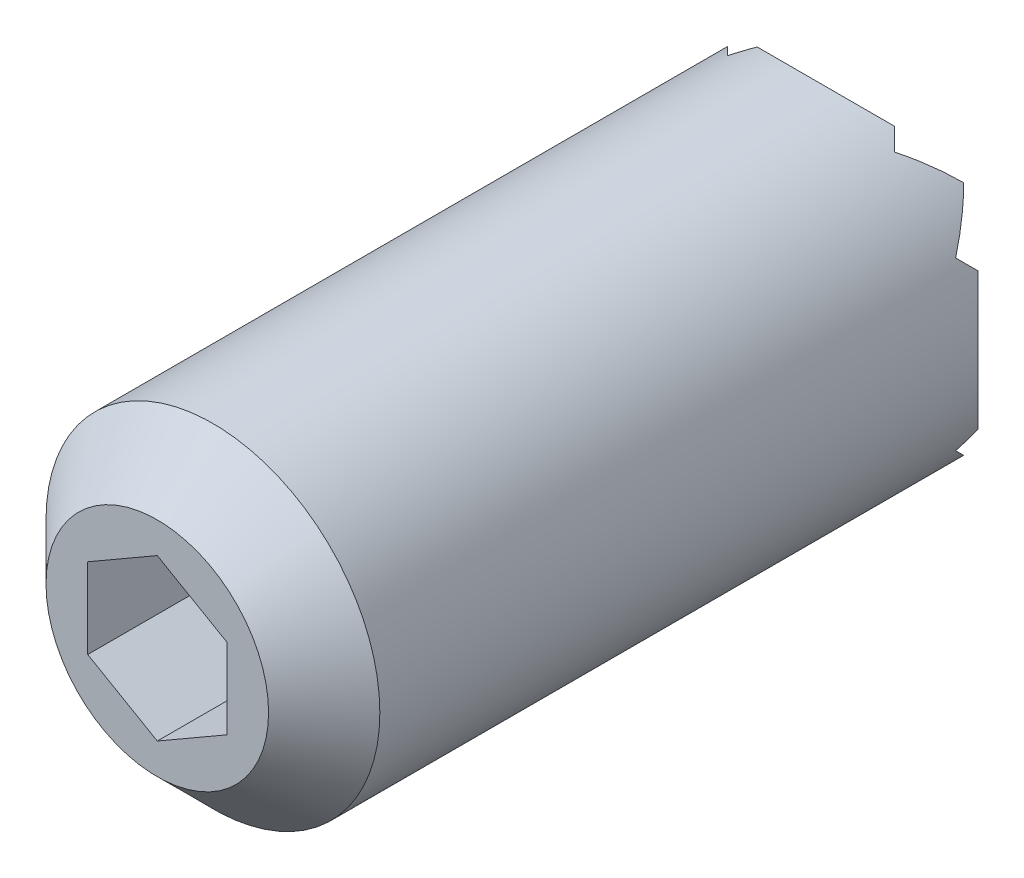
ISO-10303-21;
HEADER;
FILE_DESCRIPTION(('STEP AP214'),'2;1');
FILE_NAME('part.step','',(''),(''),'','','');
FILE_SCHEMA(('AUTOMOTIVE_DESIGN { 1 0 10303 214 1 1 1 1 }'));
ENDSEC;
DATA;
#1=APPLICATION_CONTEXT('core data for automotive mechanical design processes');
#2=APPLICATION_PROTOCOL_DEFINITION('international standard','automotive_design',2000,#1);
#3=PRODUCT_CONTEXT('',#1,'mechanical');
#4=PRODUCT('Part','Part','',(#3));
#5=PRODUCT_RELATED_PRODUCT_CATEGORY('part','',(#4));
#6=PRODUCT_DEFINITION_FORMATION('','',#4);
#7=PRODUCT_DEFINITION_CONTEXT('part definition',#1,'design');
#8=PRODUCT_DEFINITION('design','',#6,#7);
#9=PRODUCT_DEFINITION_SHAPE('','',#8);
#10=(LENGTH_UNIT() NAMED_UNIT(*) SI_UNIT(.MILLI.,.METRE.));
#11=(NAMED_UNIT(*) PLANE_ANGLE_UNIT() SI_UNIT($,.RADIAN.));
#12=(NAMED_UNIT(*) SI_UNIT($,.STERADIAN.) SOLID_ANGLE_UNIT());
#13=UNCERTAINTY_MEASURE_WITH_UNIT(LENGTH_MEASURE(1.E-05),#10,'distance_accuracy_value','');
#14=(GEOMETRIC_REPRESENTATION_CONTEXT(3) GLOBAL_UNCERTAINTY_ASSIGNED_CONTEXT((#13)) GLOBAL_UNIT_ASSIGNED_CONTEXT((#10,
#11,#12)) REPRESENTATION_CONTEXT('',''));
#15=CARTESIAN_POINT('',(0.,0.,0.));
#16=DIRECTION('',(0.,0.,1.));
#17=DIRECTION('',(1.,0.,0.));
#18=AXIS2_PLACEMENT_3D('',#15,#16,#17);
#19=CARTESIAN_POINT('',(2.9999999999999,-10.,1.5));
#20=DIRECTION('',(-0.707106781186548,0.,0.707106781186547));
#21=DIRECTION('',(0.707106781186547,0.,0.707106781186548));
#22=AXIS2_PLACEMENT_3D('',#19,#20,#21);
#23=PLANE('',#22);
#24=CARTESIAN_POINT('',(0.,0.,-1.5));
#25=DIRECTION('',(-0.707106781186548,0.,0.707106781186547));
#26=DIRECTION('',(0.707106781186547,0.,0.707106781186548));
#27=AXIS2_PLACEMENT_3D('',#24,#25,#26);
#28=ELLIPSE('',#27,8.48528137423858,6.);
#29=CARTESIAN_POINT('',(2.9999999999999,-5.19615242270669,1.5));
#30=VERTEX_POINT('',#29);
#31=CARTESIAN_POINT('',(2.46862696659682,-5.46862696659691,0.9686269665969));
#32=VERTEX_POINT('',#31);
#33=EDGE_CURVE('E361',#30,#32,#28,.F.);
#34=ORIENTED_EDGE('',*,*,#33,.T.);
#35=DIRECTION('',(-0.577350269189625,0.577350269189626,-0.577350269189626));
#36=VECTOR('',#35,1.);
#37=CARTESIAN_POINT('',(4.33333333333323,-7.33333333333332,2.83333333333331));
#38=LINE('',#37,#36);
#39=CARTESIAN_POINT('',(1.49999999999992,-4.5,0.));
#40=VERTEX_POINT('',#39);
#41=EDGE_CURVE('E281',#32,#40,#38,.T.);
#42=ORIENTED_EDGE('',*,*,#41,.T.);
#43=DIRECTION('',(0.577350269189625,0.577350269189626,0.577350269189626));
#44=VECTOR('',#43,1.);
#45=CARTESIAN_POINT('',(0.666666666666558,-5.33333333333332,-0.833333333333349));
#46=LINE('',#45,#44);
#47=CARTESIAN_POINT('',(2.9999999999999,-3.,1.5));
#48=VERTEX_POINT('',#47);
#49=EDGE_CURVE('E422',#40,#48,#46,.T.);
#50=ORIENTED_EDGE('',*,*,#49,.T.);
#51=DIRECTION('',(0.,1.,0.));
#52=VECTOR('',#51,1.);
#53=CARTESIAN_POINT('',(2.9999999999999,-10.,1.5));
#54=LINE('',#53,#52);
#55=EDGE_CURVE('E298',#30,#48,#54,.T.);
#56=ORIENTED_EDGE('',*,*,#55,.F.);
#57=EDGE_LOOP('',(#34,#42,#50,#56));
#58=FACE_BOUND('',#57,.T.);
#59=ADVANCED_FACE('F14',(#58),#23,.F.);
#60=CARTESIAN_POINT('',(-1.50000000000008,-10.,0.));
#61=DIRECTION('',(0.70710678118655,0.,0.707106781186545));
#62=DIRECTION('',(0.707106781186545,0.,-0.70710678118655));
#63=AXIS2_PLACEMENT_3D('',#60,#61,#62);
#64=PLANE('',#63);
#65=DIRECTION('',(0.577350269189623,-0.577350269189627,-0.577350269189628));
#66=VECTOR('',#65,1.);
#67=CARTESIAN_POINT('',(0.333333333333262,-6.33333333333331,-1.83333333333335));
#68=LINE('',#67,#66);
#69=CARTESIAN_POINT('',(-3.00000000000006,-3.,1.5));
#70=VERTEX_POINT('',#69);
#71=CARTESIAN_POINT('',(-1.50000000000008,-4.5,0.));
#72=VERTEX_POINT('',#71);
#73=EDGE_CURVE('E434',#70,#72,#68,.T.);
#74=ORIENTED_EDGE('',*,*,#73,.T.);
#75=DIRECTION('',(-0.577350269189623,-0.577350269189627,0.577350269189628));
#76=VECTOR('',#75,1.);
#77=CARTESIAN_POINT('',(-3.3333333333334,-6.33333333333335,1.83333333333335));
#78=LINE('',#77,#76);
#79=CARTESIAN_POINT('',(-2.46862696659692,-5.46862696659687,0.968626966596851));
#80=VERTEX_POINT('',#79);
#81=EDGE_CURVE('E9',#72,#80,#78,.T.);
#82=ORIENTED_EDGE('',*,*,#81,.T.);
#83=CARTESIAN_POINT('',(0.,0.,-1.5));
#84=DIRECTION('',(0.70710678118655,0.,0.707106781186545));
#85=DIRECTION('',(-0.707106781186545,0.,0.70710678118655));
#86=AXIS2_PLACEMENT_3D('',#83,#84,#85);
#87=ELLIPSE('',#86,8.4852813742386,6.);
#88=CARTESIAN_POINT('',(-3.00000000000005,-5.19615242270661,1.5));
#89=VERTEX_POINT('',#88);
#90=EDGE_CURVE('E365',#80,#89,#87,.F.);
#91=ORIENTED_EDGE('',*,*,#90,.T.);
#92=DIRECTION('',(0.,1.,0.));
#93=VECTOR('',#92,1.);
#94=CARTESIAN_POINT('',(-3.00000000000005,-10.,1.5));
#95=LINE('',#94,#93);
#96=EDGE_CURVE('E293',#89,#70,#95,.T.);
#97=ORIENTED_EDGE('',*,*,#96,.T.);
#98=EDGE_LOOP('',(#74,#82,#91,#97));
#99=FACE_BOUND('',#98,.T.);
#100=ADVANCED_FACE('F564',(#99),#64,.F.);
#101=CARTESIAN_POINT('',(-3.00000000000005,-10.,1.5));
#102=DIRECTION('',(-0.707106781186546,0.,0.707106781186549));
#103=DIRECTION('',(0.707106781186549,0.,0.707106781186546));
#104=AXIS2_PLACEMENT_3D('',#101,#102,#103);
#105=PLANE('',#104);
#106=CARTESIAN_POINT('',(0.,0.,4.5));
#107=DIRECTION('',(-0.707106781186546,0.,0.707106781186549));
#108=DIRECTION('',(0.707106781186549,0.,0.707106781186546));
#109=AXIS2_PLACEMENT_3D('',#106,#107,#108);
#110=ELLIPSE('',#109,8.48528137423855,6.);
#111=CARTESIAN_POINT('',(-4.24264068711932,-4.24264068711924,0.257359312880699));
#112=VERTEX_POINT('',#111);
#113=EDGE_CURVE('E367',#89,#112,#110,.F.);
#114=ORIENTED_EDGE('',*,*,#113,.T.);
#115=DIRECTION('',(0.577350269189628,0.577350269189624,0.577350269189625));
#116=VECTOR('',#115,1.);
#117=CARTESIAN_POINT('',(-5.33333333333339,-5.33333333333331,-0.833333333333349));
#118=LINE('',#117,#116);
#119=EDGE_CURVE('E436',#112,#70,#118,.T.);
#120=ORIENTED_EDGE('',*,*,#119,.T.);
#121=ORIENTED_EDGE('',*,*,#96,.F.);
#122=EDGE_LOOP('',(#114,#120,#121));
#123=FACE_BOUND('',#122,.T.);
#124=ADVANCED_FACE('F558',(#123),#105,.F.);
#125=CARTESIAN_POINT('',(-4.50000000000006,-10.,0.));
#126=DIRECTION('',(0.707106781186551,0.,0.707106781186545));
#127=DIRECTION('',(0.707106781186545,0.,-0.707106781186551));
#128=AXIS2_PLACEMENT_3D('',#125,#126,#127);
#129=PLANE('',#128);
#130=CARTESIAN_POINT('',(0.,0.,-4.5));
#131=DIRECTION('',(0.707106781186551,0.,0.707106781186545));
#132=DIRECTION('',(-0.707106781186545,0.,0.707106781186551));
#133=AXIS2_PLACEMENT_3D('',#130,#131,#132);
#134=ELLIPSE('',#133,8.48528137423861,6.);
#135=CARTESIAN_POINT('',(-6.,0.,1.5));
#136=VERTEX_POINT('',#135);
#137=CARTESIAN_POINT('',(-5.46862696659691,2.46862696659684,0.968626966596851));
#138=VERTEX_POINT('',#137);
#139=EDGE_CURVE('E371',#136,#138,#134,.F.);
#140=ORIENTED_EDGE('',*,*,#139,.T.);
#141=DIRECTION('',(0.577350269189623,-0.577350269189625,-0.577350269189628));
#142=VECTOR('',#141,1.);
#143=CARTESIAN_POINT('',(-0.666666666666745,-2.33333333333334,-3.83333333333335));
#144=LINE('',#143,#142);
#145=CARTESIAN_POINT('',(-4.50000000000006,1.5,0.));
#146=VERTEX_POINT('',#145);
#147=EDGE_CURVE('E249',#138,#146,#144,.T.);
#148=ORIENTED_EDGE('',*,*,#147,.T.);
#149=DIRECTION('',(-0.577350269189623,-0.577350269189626,0.577350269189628));
#150=VECTOR('',#149,1.);
#151=CARTESIAN_POINT('',(-8.33333333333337,-2.33333333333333,3.83333333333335));
#152=LINE('',#151,#150);
#153=EDGE_CURVE('E498',#146,#136,#152,.T.);
#154=ORIENTED_EDGE('',*,*,#153,.T.);
#155=EDGE_LOOP('',(#140,#148,#154));
#156=FACE_BOUND('',#155,.T.);
#157=ADVANCED_FACE('F680',(#156),#129,.F.);
#158=CARTESIAN_POINT('',(5.99999999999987,-10.,1.5));
#159=DIRECTION('',(-0.707106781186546,0.,0.70710678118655));
#160=DIRECTION('',(0.70710678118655,0.,0.707106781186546));
#161=AXIS2_PLACEMENT_3D('',#158,#159,#160);
#162=PLANE('',#161);
#163=DIRECTION('',(-0.577350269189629,0.577350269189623,-0.577350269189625));
#164=VECTOR('',#163,1.);
#165=CARTESIAN_POINT('',(9.33333333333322,-3.33333333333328,4.8333333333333));
#166=LINE('',#165,#164);
#167=CARTESIAN_POINT('',(5.99999999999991,0.,1.5));
#168=VERTEX_POINT('',#167);
#169=CARTESIAN_POINT('',(4.49999999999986,1.5,0.));
#170=VERTEX_POINT('',#169);
#171=EDGE_CURVE('E480',#168,#170,#166,.T.);
#172=ORIENTED_EDGE('',*,*,#171,.T.);
#173=DIRECTION('',(0.577350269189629,0.577350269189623,0.577350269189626));
#174=VECTOR('',#173,1.);
#175=CARTESIAN_POINT('',(1.66666666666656,-1.33333333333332,-2.83333333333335));
#176=LINE('',#175,#174);
#177=CARTESIAN_POINT('',(5.46862696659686,2.46862696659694,0.968626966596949));
#178=VERTEX_POINT('',#177);
#179=EDGE_CURVE('E246',#170,#178,#176,.T.);
#180=ORIENTED_EDGE('',*,*,#179,.T.);
#181=CARTESIAN_POINT('',(0.,0.,-4.5));
#182=DIRECTION('',(-0.707106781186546,0.,0.70710678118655));
#183=DIRECTION('',(0.70710678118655,0.,0.707106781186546));
#184=AXIS2_PLACEMENT_3D('',#181,#182,#183);
#185=ELLIPSE('',#184,8.48528137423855,6.);
#186=EDGE_CURVE('E237',#178,#168,#185,.F.);
#187=ORIENTED_EDGE('',*,*,#186,.T.);
#188=EDGE_LOOP('',(#172,#180,#187));
#189=FACE_BOUND('',#188,.T.);
#190=ADVANCED_FACE('F501',(#189),#162,.F.);
#191=CARTESIAN_POINT('',(4.49999999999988,-10.,0.));
#192=DIRECTION('',(0.70710678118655,0.,0.707106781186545));
#193=DIRECTION('',(0.707106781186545,0.,-0.70710678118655));
#194=AXIS2_PLACEMENT_3D('',#191,#192,#193);
#195=PLANE('',#194);
#196=ORIENTED_EDGE('',*,*,#55,.T.);
#197=DIRECTION('',(0.577350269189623,-0.577350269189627,-0.577350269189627));
#198=VECTOR('',#197,1.);
#199=CARTESIAN_POINT('',(6.33333333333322,-6.33333333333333,-1.83333333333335));
#200=LINE('',#199,#198);
#201=CARTESIAN_POINT('',(4.24264068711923,-4.24264068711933,0.25735931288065));
#202=VERTEX_POINT('',#201);
#203=EDGE_CURVE('E386',#48,#202,#200,.T.);
#204=ORIENTED_EDGE('',*,*,#203,.T.);
#205=CARTESIAN_POINT('',(0.,0.,4.5));
#206=DIRECTION('',(0.70710678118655,0.,0.707106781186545));
#207=DIRECTION('',(-0.707106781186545,0.,0.70710678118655));
#208=AXIS2_PLACEMENT_3D('',#205,#206,#207);
#209=ELLIPSE('',#208,8.4852813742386,6.);
#210=EDGE_CURVE('E355',#202,#30,#209,.F.);
#211=ORIENTED_EDGE('',*,*,#210,.T.);
#212=EDGE_LOOP('',(#196,#204,#211));
#213=FACE_BOUND('',#212,.T.);
#214=ADVANCED_FACE('F665',(#213),#195,.F.);
#215=CARTESIAN_POINT('',(0.,0.,45.));
#216=DIRECTION('',(0.,0.,1.));
#217=DIRECTION('',(1.,0.,0.));
#218=AXIS2_PLACEMENT_3D('',#215,#216,#217);
#219=CYLINDRICAL_SURFACE('',#218,6.);
#220=CARTESIAN_POINT('',(0.,0.,-1.5));
#221=DIRECTION('',(0.,0.707106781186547,0.707106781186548));
#222=DIRECTION('',(0.,-0.707106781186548,0.707106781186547));
#223=AXIS2_PLACEMENT_3D('',#220,#221,#222);
#224=ELLIPSE('',#223,8.48528137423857,6.);
#225=CARTESIAN_POINT('',(5.46862696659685,-2.46862696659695,0.968626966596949));
#226=VERTEX_POINT('',#225);
#227=CARTESIAN_POINT('',(5.19615242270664,-3.,1.5));
#228=VERTEX_POINT('',#227);
#229=EDGE_CURVE('E445',#226,#228,#224,.F.);
#230=ORIENTED_EDGE('',*,*,#229,.F.);
#231=EDGE_CURVE('E357',#168,#226,#185,.F.);
#232=ORIENTED_EDGE('',*,*,#231,.F.);
#233=ORIENTED_EDGE('',*,*,#186,.F.);
#234=CARTESIAN_POINT('',(0.,0.,-1.5));
#235=DIRECTION('',(0.,-0.70710678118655,0.707106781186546));
#236=DIRECTION('',(0.,0.707106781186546,0.70710678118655));
#237=AXIS2_PLACEMENT_3D('',#234,#235,#236);
#238=ELLIPSE('',#237,8.48528137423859,6.);
#239=CARTESIAN_POINT('',(5.19615242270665,3.,1.5));
#240=VERTEX_POINT('',#239);
#241=EDGE_CURVE('E223',#240,#178,#238,.F.);
#242=ORIENTED_EDGE('',*,*,#241,.F.);
#243=CARTESIAN_POINT('',(0.,0.,4.5));
#244=DIRECTION('',(0.,0.707106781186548,0.707106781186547));
#245=DIRECTION('',(0.,-0.707106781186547,0.707106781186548));
#246=AXIS2_PLACEMENT_3D('',#243,#244,#245);
#247=ELLIPSE('',#246,8.48528137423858,6.);
#248=CARTESIAN_POINT('',(4.24264068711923,4.24264068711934,0.25735931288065));
#249=VERTEX_POINT('',#248);
#250=EDGE_CURVE('E205',#249,#240,#247,.F.);
#251=ORIENTED_EDGE('',*,*,#250,.F.);
#252=CARTESIAN_POINT('',(2.9999999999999,5.1961524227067,1.5));
#253=VERTEX_POINT('',#252);
#254=EDGE_CURVE('E358',#253,#249,#209,.F.);
#255=ORIENTED_EDGE('',*,*,#254,.F.);
#256=CARTESIAN_POINT('',(2.46862696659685,5.4686269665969,0.968626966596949));
#257=VERTEX_POINT('',#256);
#258=EDGE_CURVE('E364',#257,#253,#28,.F.);
#259=ORIENTED_EDGE('',*,*,#258,.F.);
#260=CARTESIAN_POINT('',(0.,0.,-4.5));
#261=DIRECTION('',(0.,-0.707106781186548,0.707106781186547));
#262=DIRECTION('',(0.,0.707106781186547,0.707106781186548));
#263=AXIS2_PLACEMENT_3D('',#260,#261,#262);
#264=ELLIPSE('',#263,8.48528137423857,6.);
#265=CARTESIAN_POINT('',(0.,6.,1.5));
#266=VERTEX_POINT('',#265);
#267=EDGE_CURVE('E276',#266,#257,#264,.F.);
#268=ORIENTED_EDGE('',*,*,#267,.F.);
#269=CARTESIAN_POINT('',(-2.46862696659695,5.46862696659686,0.9686269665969));
#270=VERTEX_POINT('',#269);
#271=EDGE_CURVE('E273',#270,#266,#264,.F.);
#272=ORIENTED_EDGE('',*,*,#271,.F.);
#273=CARTESIAN_POINT('',(-3.00000000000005,5.19615242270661,1.5));
#274=VERTEX_POINT('',#273);
#275=EDGE_CURVE('E368',#274,#270,#87,.F.);
#276=ORIENTED_EDGE('',*,*,#275,.F.);
#277=CARTESIAN_POINT('',(-4.24264068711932,4.24264068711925,0.257359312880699));
#278=VERTEX_POINT('',#277);
#279=EDGE_CURVE('E372',#278,#274,#110,.F.);
#280=ORIENTED_EDGE('',*,*,#279,.F.);
#281=CARTESIAN_POINT('',(-5.19615242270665,3.,1.5));
#282=VERTEX_POINT('',#281);
#283=EDGE_CURVE('E219',#282,#278,#247,.F.);
#284=ORIENTED_EDGE('',*,*,#283,.F.);
#285=EDGE_CURVE('E241',#138,#282,#238,.F.);
#286=ORIENTED_EDGE('',*,*,#285,.F.);
#287=ORIENTED_EDGE('',*,*,#139,.F.);
#288=CARTESIAN_POINT('',(-5.4686269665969,-2.46862696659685,0.968626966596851));
#289=VERTEX_POINT('',#288);
#290=EDGE_CURVE('E374',#289,#136,#134,.F.);
#291=ORIENTED_EDGE('',*,*,#290,.F.);
#292=CARTESIAN_POINT('',(-5.19615242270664,-3.,1.5));
#293=VERTEX_POINT('',#292);
#294=EDGE_CURVE('E447',#293,#289,#224,.F.);
#295=ORIENTED_EDGE('',*,*,#294,.F.);
#296=CARTESIAN_POINT('',(0.,0.,4.5));
#297=DIRECTION('',(0.,-0.707106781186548,0.707106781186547));
#298=DIRECTION('',(0.,0.707106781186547,0.707106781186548));
#299=AXIS2_PLACEMENT_3D('',#296,#297,#298);
#300=ELLIPSE('',#299,8.48528137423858,6.);
#301=EDGE_CURVE('E428',#112,#293,#300,.F.);
#302=ORIENTED_EDGE('',*,*,#301,.F.);
#303=ORIENTED_EDGE('',*,*,#113,.F.);
#304=ORIENTED_EDGE('',*,*,#90,.F.);
#305=CARTESIAN_POINT('',(0.,0.,-4.5));
#306=DIRECTION('',(0.,0.707106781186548,0.707106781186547));
#307=DIRECTION('',(0.,-0.707106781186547,0.707106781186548));
#308=AXIS2_PLACEMENT_3D('',#305,#306,#307);
#309=ELLIPSE('',#308,8.48528137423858,6.);
#310=CARTESIAN_POINT('',(-1.28586377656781E-13,-6.,1.5));
#311=VERTEX_POINT('',#310);
#312=EDGE_CURVE('E286',#311,#80,#309,.F.);
#313=ORIENTED_EDGE('',*,*,#312,.F.);
#314=EDGE_CURVE('E284',#32,#311,#309,.F.);
#315=ORIENTED_EDGE('',*,*,#314,.F.);
#316=ORIENTED_EDGE('',*,*,#33,.F.);
#317=ORIENTED_EDGE('',*,*,#210,.F.);
#318=EDGE_CURVE('E425',#228,#202,#300,.F.);
#319=ORIENTED_EDGE('',*,*,#318,.F.);
#320=EDGE_LOOP('',(#230,#232,#233,#242,#251,#255,#259,#268,#272,#276,#280,#284,#286,#287,#291,
#295,#302,#303,#304,#313,#315,#316,#317,#319));
#321=FACE_BOUND('',#320,.T.);
#322=CARTESIAN_POINT('',(0.,0.,23.));
#323=DIRECTION('',(0.,0.,1.));
#324=DIRECTION('',(1.,0.,0.));
#325=AXIS2_PLACEMENT_3D('',#322,#323,#324);
#326=CIRCLE('',#325,6.);
#327=CARTESIAN_POINT('',(6.,0.,23.));
#328=VERTEX_POINT('',#327);
#329=EDGE_CURVE('E352',#328,#328,#326,.F.);
#330=ORIENTED_EDGE('',*,*,#329,.T.);
#331=EDGE_LOOP('',(#330));
#332=FACE_BOUND('',#331,.T.);
#333=ADVANCED_FACE('F233',(#321,#332),#219,.T.);
#334=CARTESIAN_POINT('',(0.,0.,25.));
#335=DIRECTION('',(0.,0.,1.));
#336=DIRECTION('',(1.,0.,0.));
#337=AXIS2_PLACEMENT_3D('',#334,#335,#336);
#338=PLANE('',#337);
#339=CARTESIAN_POINT('',(0.,0.,25.));
#340=DIRECTION('',(0.,0.,1.));
#341=DIRECTION('',(1.,0.,0.));
#342=AXIS2_PLACEMENT_3D('',#339,#340,#341);
#343=CIRCLE('',#342,4.);
#344=CARTESIAN_POINT('',(4.,0.,25.));
#345=VERTEX_POINT('',#344);
#346=EDGE_CURVE('E349',#345,#345,#343,.T.);
#347=ORIENTED_EDGE('',*,*,#346,.T.);
#348=EDGE_LOOP('',(#347));
#349=FACE_BOUND('',#348,.T.);
#350=DIRECTION('',(0.86602540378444,-0.5,0.));
#351=VECTOR('',#350,1.);
#352=CARTESIAN_POINT('',(-2.5,-1.44337567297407,25.));
#353=LINE('',#352,#351);
#354=CARTESIAN_POINT('',(-2.5,-1.44337567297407,25.));
#355=VERTEX_POINT('',#354);
#356=CARTESIAN_POINT('',(0.,-2.88675134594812,25.));
#357=VERTEX_POINT('',#356);
#358=EDGE_CURVE('E290',#355,#357,#353,.T.);
#359=ORIENTED_EDGE('',*,*,#358,.F.);
#360=DIRECTION('',(0.,-1.,0.));
#361=VECTOR('',#360,1.);
#362=CARTESIAN_POINT('',(-2.5,1.44337567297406,25.));
#363=LINE('',#362,#361);
#364=CARTESIAN_POINT('',(-2.5,1.44337567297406,25.));
#365=VERTEX_POINT('',#364);
#366=EDGE_CURVE('E315',#365,#355,#363,.T.);
#367=ORIENTED_EDGE('',*,*,#366,.F.);
#368=DIRECTION('',(0.866025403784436,0.5,0.));
#369=VECTOR('',#368,1.);
#370=CARTESIAN_POINT('',(-2.5,1.44337567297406,25.));
#371=LINE('',#370,#369);
#372=CARTESIAN_POINT('',(0.,2.88675134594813,25.));
#373=VERTEX_POINT('',#372);
#374=EDGE_CURVE('E312',#365,#373,#371,.T.);
#375=ORIENTED_EDGE('',*,*,#374,.T.);
#376=DIRECTION('',(-0.866025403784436,0.5,0.));
#377=VECTOR('',#376,1.);
#378=CARTESIAN_POINT('',(2.5,1.44337567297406,25.));
#379=LINE('',#378,#377);
#380=CARTESIAN_POINT('',(2.5,1.44337567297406,25.));
#381=VERTEX_POINT('',#380);
#382=EDGE_CURVE('E309',#381,#373,#379,.T.);
#383=ORIENTED_EDGE('',*,*,#382,.F.);
#384=DIRECTION('',(0.,-1.,0.));
#385=VECTOR('',#384,1.);
#386=CARTESIAN_POINT('',(2.5,1.44337567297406,25.));
#387=LINE('',#386,#385);
#388=CARTESIAN_POINT('',(2.5,-1.44337567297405,25.));
#389=VERTEX_POINT('',#388);
#390=EDGE_CURVE('E306',#381,#389,#387,.T.);
#391=ORIENTED_EDGE('',*,*,#390,.T.);
#392=DIRECTION('',(-0.866025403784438,-0.5,0.));
#393=VECTOR('',#392,1.);
#394=CARTESIAN_POINT('',(2.5,-1.44337567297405,25.));
#395=LINE('',#394,#393);
#396=EDGE_CURVE('E303',#389,#357,#395,.T.);
#397=ORIENTED_EDGE('',*,*,#396,.T.);
#398=EDGE_LOOP('',(#359,#367,#375,#383,#391,#397));
#399=FACE_BOUND('',#398,.T.);
#400=ADVANCED_FACE('F679',(#349,#399),#338,.T.);
#401=CARTESIAN_POINT('',(-2.5,-1.44337567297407,19.));
#402=DIRECTION('',(-0.5,-0.86602540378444,0.));
#403=DIRECTION('',(-0.86602540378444,0.5,0.));
#404=AXIS2_PLACEMENT_3D('',#401,#402,#403);
#405=PLANE('',#404);
#406=DIRECTION('',(0.,0.,1.));
#407=VECTOR('',#406,1.);
#408=CARTESIAN_POINT('',(-2.5,-1.44337567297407,19.));
#409=LINE('',#408,#407);
#410=CARTESIAN_POINT('',(-2.5,-1.44337567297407,19.));
#411=VERTEX_POINT('',#410);
#412=EDGE_CURVE('E347',#411,#355,#409,.T.);
#413=ORIENTED_EDGE('',*,*,#412,.T.);
#414=ORIENTED_EDGE('',*,*,#358,.T.);
#415=DIRECTION('',(0.,0.,1.));
#416=VECTOR('',#415,1.);
#417=CARTESIAN_POINT('',(0.,-2.88675134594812,19.));
#418=LINE('',#417,#416);
#419=CARTESIAN_POINT('',(0.,-2.88675134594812,19.));
#420=VERTEX_POINT('',#419);
#421=EDGE_CURVE('E336',#420,#357,#418,.T.);
#422=ORIENTED_EDGE('',*,*,#421,.F.);
#423=DIRECTION('',(0.86602540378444,-0.5,0.));
#424=VECTOR('',#423,1.);
#425=CARTESIAN_POINT('',(-2.5,-1.44337567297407,19.));
#426=LINE('',#425,#424);
#427=EDGE_CURVE('E318',#411,#420,#426,.T.);
#428=ORIENTED_EDGE('',*,*,#427,.F.);
#429=EDGE_LOOP('',(#413,#414,#422,#428));
#430=FACE_BOUND('',#429,.T.);
#431=ADVANCED_FACE('F1125',(#430),#405,.F.);
#432=CARTESIAN_POINT('',(-2.5,1.44337567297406,19.));
#433=DIRECTION('',(-1.,0.,0.));
#434=DIRECTION('',(0.,1.,0.));
#435=AXIS2_PLACEMENT_3D('',#432,#433,#434);
#436=PLANE('',#435);
#437=DIRECTION('',(0.,0.,1.));
#438=VECTOR('',#437,1.);
#439=CARTESIAN_POINT('',(-2.5,1.44337567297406,19.));
#440=LINE('',#439,#438);
#441=CARTESIAN_POINT('',(-2.5,1.44337567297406,19.));
#442=VERTEX_POINT('',#441);
#443=EDGE_CURVE('E345',#442,#365,#440,.T.);
#444=ORIENTED_EDGE('',*,*,#443,.T.);
#445=ORIENTED_EDGE('',*,*,#366,.T.);
#446=ORIENTED_EDGE('',*,*,#412,.F.);
#447=DIRECTION('',(0.,-1.,0.));
#448=VECTOR('',#447,1.);
#449=CARTESIAN_POINT('',(-2.5,1.44337567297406,19.));
#450=LINE('',#449,#448);
#451=EDGE_CURVE('E333',#442,#411,#450,.T.);
#452=ORIENTED_EDGE('',*,*,#451,.F.);
#453=EDGE_LOOP('',(#444,#445,#446,#452));
#454=FACE_BOUND('',#453,.T.);
#455=ADVANCED_FACE('F1116',(#454),#436,.F.);
#456=CARTESIAN_POINT('',(-2.5,1.44337567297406,19.));
#457=DIRECTION('',(0.5,-0.866025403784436,0.));
#458=DIRECTION('',(-0.866025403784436,-0.5,0.));
#459=AXIS2_PLACEMENT_3D('',#456,#457,#458);
#460=PLANE('',#459);
#461=DIRECTION('',(0.,0.,1.));
#462=VECTOR('',#461,1.);
#463=CARTESIAN_POINT('',(0.,2.88675134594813,19.));
#464=LINE('',#463,#462);
#465=CARTESIAN_POINT('',(0.,2.88675134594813,19.));
#466=VERTEX_POINT('',#465);
#467=EDGE_CURVE('E343',#466,#373,#464,.T.);
#468=ORIENTED_EDGE('',*,*,#467,.T.);
#469=ORIENTED_EDGE('',*,*,#374,.F.);
#470=ORIENTED_EDGE('',*,*,#443,.F.);
#471=DIRECTION('',(0.866025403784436,0.5,0.));
#472=VECTOR('',#471,1.);
#473=CARTESIAN_POINT('',(-2.5,1.44337567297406,19.));
#474=LINE('',#473,#472);
#475=EDGE_CURVE('E330',#442,#466,#474,.T.);
#476=ORIENTED_EDGE('',*,*,#475,.T.);
#477=EDGE_LOOP('',(#468,#469,#470,#476));
#478=FACE_BOUND('',#477,.T.);
#479=ADVANCED_FACE('F1107',(#478),#460,.T.);
#480=CARTESIAN_POINT('',(2.5,1.44337567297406,19.));
#481=DIRECTION('',(0.5,0.866025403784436,0.));
#482=DIRECTION('',(0.866025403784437,-0.5,0.));
#483=AXIS2_PLACEMENT_3D('',#480,#481,#482);
#484=PLANE('',#483);
#485=DIRECTION('',(0.,0.,1.));
#486=VECTOR('',#485,1.);
#487=CARTESIAN_POINT('',(2.5,1.44337567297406,19.));
#488=LINE('',#487,#486);
#489=CARTESIAN_POINT('',(2.5,1.44337567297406,19.));
#490=VERTEX_POINT('',#489);
#491=EDGE_CURVE('E341',#490,#381,#488,.T.);
#492=ORIENTED_EDGE('',*,*,#491,.T.);
#493=ORIENTED_EDGE('',*,*,#382,.T.);
#494=ORIENTED_EDGE('',*,*,#467,.F.);
#495=DIRECTION('',(-0.866025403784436,0.5,0.));
#496=VECTOR('',#495,1.);
#497=CARTESIAN_POINT('',(2.5,1.44337567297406,19.));
#498=LINE('',#497,#496);
#499=EDGE_CURVE('E327',#490,#466,#498,.T.);
#500=ORIENTED_EDGE('',*,*,#499,.F.);
#501=EDGE_LOOP('',(#492,#493,#494,#500));
#502=FACE_BOUND('',#501,.T.);
#503=ADVANCED_FACE('F1098',(#502),#484,.F.);
#504=CARTESIAN_POINT('',(2.5,1.44337567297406,19.));
#505=DIRECTION('',(-1.,0.,0.));
#506=DIRECTION('',(0.,1.,0.));
#507=AXIS2_PLACEMENT_3D('',#504,#505,#506);
#508=PLANE('',#507);
#509=DIRECTION('',(0.,0.,1.));
#510=VECTOR('',#509,1.);
#511=CARTESIAN_POINT('',(2.5,-1.44337567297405,19.));
#512=LINE('',#511,#510);
#513=CARTESIAN_POINT('',(2.5,-1.44337567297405,19.));
#514=VERTEX_POINT('',#513);
#515=EDGE_CURVE('E339',#514,#389,#512,.T.);
#516=ORIENTED_EDGE('',*,*,#515,.T.);
#517=ORIENTED_EDGE('',*,*,#390,.F.);
#518=ORIENTED_EDGE('',*,*,#491,.F.);
#519=DIRECTION('',(0.,-1.,0.));
#520=VECTOR('',#519,1.);
#521=CARTESIAN_POINT('',(2.5,1.44337567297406,19.));
#522=LINE('',#521,#520);
#523=EDGE_CURVE('E324',#490,#514,#522,.T.);
#524=ORIENTED_EDGE('',*,*,#523,.T.);
#525=EDGE_LOOP('',(#516,#517,#518,#524));
#526=FACE_BOUND('',#525,.T.);
#527=ADVANCED_FACE('F1083',(#526),#508,.T.);
#528=CARTESIAN_POINT('',(2.5,-1.44337567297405,19.));
#529=DIRECTION('',(-0.5,0.866025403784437,0.));
#530=DIRECTION('',(0.866025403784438,0.5,0.));
#531=AXIS2_PLACEMENT_3D('',#528,#529,#530);
#532=PLANE('',#531);
#533=DIRECTION('',(-0.866025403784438,-0.5,0.));
#534=VECTOR('',#533,1.);
#535=CARTESIAN_POINT('',(2.5,-1.44337567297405,19.));
#536=LINE('',#535,#534);
#537=EDGE_CURVE('E321',#514,#420,#536,.T.);
#538=ORIENTED_EDGE('',*,*,#537,.T.);
#539=ORIENTED_EDGE('',*,*,#421,.T.);
#540=ORIENTED_EDGE('',*,*,#396,.F.);
#541=ORIENTED_EDGE('',*,*,#515,.F.);
#542=EDGE_LOOP('',(#538,#539,#540,#541));
#543=FACE_BOUND('',#542,.T.);
#544=ADVANCED_FACE('F644',(#543),#532,.T.);
#545=CARTESIAN_POINT('',(-5.,0.,19.));
#546=DIRECTION('',(0.,0.,1.));
#547=DIRECTION('',(1.,0.,0.));
#548=AXIS2_PLACEMENT_3D('',#545,#546,#547);
#549=PLANE('',#548);
#550=ORIENTED_EDGE('',*,*,#427,.T.);
#551=ORIENTED_EDGE('',*,*,#537,.F.);
#552=ORIENTED_EDGE('',*,*,#523,.F.);
#553=ORIENTED_EDGE('',*,*,#499,.T.);
#554=ORIENTED_EDGE('',*,*,#475,.F.);
#555=ORIENTED_EDGE('',*,*,#451,.T.);
#556=EDGE_LOOP('',(#550,#551,#552,#553,#554,#555));
#557=FACE_BOUND('',#556,.T.);
#558=ADVANCED_FACE('F642',(#557),#549,.T.);
#559=CARTESIAN_POINT('',(0.,0.,25.));
#560=DIRECTION('',(0.,0.,-1.));
#561=DIRECTION('',(-1.,0.,0.));
#562=AXIS2_PLACEMENT_3D('',#559,#560,#561);
#563=CONICAL_SURFACE('',#562,4.,0.785398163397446);
#564=ORIENTED_EDGE('',*,*,#329,.F.);
#565=EDGE_LOOP('',(#564));
#566=FACE_BOUND('',#565,.T.);
#567=ORIENTED_EDGE('',*,*,#346,.F.);
#568=EDGE_LOOP('',(#567));
#569=FACE_BOUND('',#568,.T.);
#570=ADVANCED_FACE('F16',(#566,#569),#563,.T.);
#571=DIRECTION('',(-0.577350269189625,0.577350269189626,-0.577350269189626));
#572=VECTOR('',#571,1.);
#573=CARTESIAN_POINT('',(7.33333333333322,-1.33333333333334,5.8333333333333));
#574=LINE('',#573,#572);
#575=CARTESIAN_POINT('',(2.99999999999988,3.,1.5));
#576=VERTEX_POINT('',#575);
#577=CARTESIAN_POINT('',(1.4999999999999,4.5,0.));
#578=VERTEX_POINT('',#577);
#579=EDGE_CURVE('E217',#576,#578,#574,.T.);
#580=ORIENTED_EDGE('',*,*,#579,.T.);
#581=DIRECTION('',(0.577350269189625,0.577350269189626,0.577350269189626));
#582=VECTOR('',#581,1.);
#583=CARTESIAN_POINT('',(-2.33333333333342,0.66666666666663,-3.83333333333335));
#584=LINE('',#583,#582);
#585=EDGE_CURVE('E270',#578,#257,#584,.T.);
#586=ORIENTED_EDGE('',*,*,#585,.T.);
#587=ORIENTED_EDGE('',*,*,#258,.T.);
#588=EDGE_CURVE('E301',#576,#253,#54,.T.);
#589=ORIENTED_EDGE('',*,*,#588,.F.);
#590=EDGE_LOOP('',(#580,#586,#587,#589));
#591=FACE_BOUND('',#590,.T.);
#592=ADVANCED_FACE('F624',(#591),#23,.F.);
#593=ORIENTED_EDGE('',*,*,#275,.T.);
#594=DIRECTION('',(0.577350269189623,-0.577350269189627,-0.577350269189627));
#595=VECTOR('',#594,1.);
#596=CARTESIAN_POINT('',(3.33333333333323,-0.33333333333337,-4.83333333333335));
#597=LINE('',#596,#595);
#598=CARTESIAN_POINT('',(-1.50000000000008,4.5,0.));
#599=VERTEX_POINT('',#598);
#600=EDGE_CURVE('E22',#270,#599,#597,.T.);
#601=ORIENTED_EDGE('',*,*,#600,.T.);
#602=DIRECTION('',(-0.577350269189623,-0.577350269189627,0.577350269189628));
#603=VECTOR('',#602,1.);
#604=CARTESIAN_POINT('',(-6.33333333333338,-0.333333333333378,4.83333333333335));
#605=LINE('',#604,#603);
#606=CARTESIAN_POINT('',(-3.00000000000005,3.,1.5));
#607=VERTEX_POINT('',#606);
#608=EDGE_CURVE('E393',#599,#607,#605,.T.);
#609=ORIENTED_EDGE('',*,*,#608,.T.);
#610=EDGE_CURVE('E297',#607,#274,#95,.T.);
#611=ORIENTED_EDGE('',*,*,#610,.T.);
#612=EDGE_LOOP('',(#593,#601,#609,#611));
#613=FACE_BOUND('',#612,.T.);
#614=ADVANCED_FACE('F392',(#613),#64,.F.);
#615=ORIENTED_EDGE('',*,*,#610,.F.);
#616=DIRECTION('',(-0.577350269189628,0.577350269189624,-0.577350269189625));
#617=VECTOR('',#616,1.);
#618=CARTESIAN_POINT('',(1.33333333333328,-1.33333333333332,5.8333333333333));
#619=LINE('',#618,#617);
#620=EDGE_CURVE('E407',#607,#278,#619,.T.);
#621=ORIENTED_EDGE('',*,*,#620,.T.);
#622=ORIENTED_EDGE('',*,*,#279,.T.);
#623=EDGE_LOOP('',(#615,#621,#622));
#624=FACE_BOUND('',#623,.T.);
#625=ADVANCED_FACE('F640',(#624),#105,.F.);
#626=ORIENTED_EDGE('',*,*,#290,.T.);
#627=DIRECTION('',(0.577350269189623,-0.577350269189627,-0.577350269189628));
#628=VECTOR('',#627,1.);
#629=CARTESIAN_POINT('',(-1.66666666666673,-4.33333333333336,-2.83333333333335));
#630=LINE('',#629,#628);
#631=CARTESIAN_POINT('',(-4.50000000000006,-1.5,0.));
#632=VERTEX_POINT('',#631);
#633=EDGE_CURVE('E478',#136,#632,#630,.T.);
#634=ORIENTED_EDGE('',*,*,#633,.T.);
#635=DIRECTION('',(-0.577350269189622,-0.577350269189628,0.577350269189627));
#636=VECTOR('',#635,1.);
#637=CARTESIAN_POINT('',(-7.33333333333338,-4.33333333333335,2.83333333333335));
#638=LINE('',#637,#636);
#639=EDGE_CURVE('E458',#632,#289,#638,.T.);
#640=ORIENTED_EDGE('',*,*,#639,.T.);
#641=EDGE_LOOP('',(#626,#634,#640));
#642=FACE_BOUND('',#641,.T.);
#643=ADVANCED_FACE('F791',(#642),#129,.F.);
#644=DIRECTION('',(-0.577350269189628,0.577350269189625,-0.577350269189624));
#645=VECTOR('',#644,1.);
#646=CARTESIAN_POINT('',(8.33333333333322,-5.33333333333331,3.83333333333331));
#647=LINE('',#646,#645);
#648=CARTESIAN_POINT('',(4.49999999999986,-1.5,0.));
#649=VERTEX_POINT('',#648);
#650=EDGE_CURVE('E439',#226,#649,#647,.T.);
#651=ORIENTED_EDGE('',*,*,#650,.T.);
#652=DIRECTION('',(0.577350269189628,0.577350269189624,0.577350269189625));
#653=VECTOR('',#652,1.);
#654=CARTESIAN_POINT('',(2.66666666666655,-3.33333333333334,-1.83333333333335));
#655=LINE('',#654,#653);
#656=EDGE_CURVE('E461',#649,#168,#655,.T.);
#657=ORIENTED_EDGE('',*,*,#656,.T.);
#658=ORIENTED_EDGE('',*,*,#231,.T.);
#659=EDGE_LOOP('',(#651,#657,#658));
#660=FACE_BOUND('',#659,.T.);
#661=ADVANCED_FACE('F663',(#660),#162,.F.);
#662=ORIENTED_EDGE('',*,*,#254,.T.);
#663=DIRECTION('',(-0.577350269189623,-0.577350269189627,0.577350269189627));
#664=VECTOR('',#663,1.);
#665=CARTESIAN_POINT('',(-0.333333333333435,-0.333333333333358,4.83333333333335));
#666=LINE('',#665,#664);
#667=EDGE_CURVE('E211',#249,#576,#666,.T.);
#668=ORIENTED_EDGE('',*,*,#667,.T.);
#669=ORIENTED_EDGE('',*,*,#588,.T.);
#670=EDGE_LOOP('',(#662,#668,#669));
#671=FACE_BOUND('',#670,.T.);
#672=ADVANCED_FACE('F655',(#671),#195,.F.);
#673=CARTESIAN_POINT('',(10.,4.5,0.));
#674=DIRECTION('',(0.,0.707106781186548,0.707106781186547));
#675=DIRECTION('',(0.,0.707106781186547,-0.707106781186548));
#676=AXIS2_PLACEMENT_3D('',#673,#674,#675);
#677=PLANE('',#676);
#678=ORIENTED_EDGE('',*,*,#250,.T.);
#679=DIRECTION('',(-1.,0.,0.));
#680=VECTOR('',#679,1.);
#681=CARTESIAN_POINT('',(10.,3.,1.5));
#682=LINE('',#681,#680);
#683=EDGE_CURVE('E208',#240,#576,#682,.T.);
#684=ORIENTED_EDGE('',*,*,#683,.T.);
#685=ORIENTED_EDGE('',*,*,#667,.F.);
#686=EDGE_LOOP('',(#678,#684,#685));
#687=FACE_BOUND('',#686,.T.);
#688=ADVANCED_FACE('F207',(#687),#677,.F.);
#689=CARTESIAN_POINT('',(10.,3.,1.5));
#690=DIRECTION('',(0.,-0.70710678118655,0.707106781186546));
#691=DIRECTION('',(0.,0.707106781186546,0.70710678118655));
#692=AXIS2_PLACEMENT_3D('',#689,#690,#691);
#693=PLANE('',#692);
#694=ORIENTED_EDGE('',*,*,#241,.T.);
#695=ORIENTED_EDGE('',*,*,#179,.F.);
#696=DIRECTION('',(0.577350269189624,-0.577350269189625,-0.577350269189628));
#697=VECTOR('',#696,1.);
#698=CARTESIAN_POINT('',(8.33333333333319,-2.33333333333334,-3.83333333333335));
#699=LINE('',#698,#697);
#700=EDGE_CURVE('E226',#576,#170,#699,.T.);
#701=ORIENTED_EDGE('',*,*,#700,.F.);
#702=ORIENTED_EDGE('',*,*,#683,.F.);
#703=EDGE_LOOP('',(#694,#695,#701,#702));
#704=FACE_BOUND('',#703,.T.);
#705=ADVANCED_FACE('F221',(#704),#693,.F.);
#706=CARTESIAN_POINT('',(10.,-3.,1.5));
#707=DIRECTION('',(0.,-0.707106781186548,0.707106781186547));
#708=DIRECTION('',(0.,0.707106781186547,0.707106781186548));
#709=AXIS2_PLACEMENT_3D('',#706,#707,#708);
#710=PLANE('',#709);
#711=ORIENTED_EDGE('',*,*,#318,.T.);
#712=ORIENTED_EDGE('',*,*,#203,.F.);
#713=DIRECTION('',(-1.,0.,0.));
#714=VECTOR('',#713,1.);
#715=CARTESIAN_POINT('',(10.,-3.,1.5));
#716=LINE('',#715,#714);
#717=EDGE_CURVE('E532',#228,#48,#716,.T.);
#718=ORIENTED_EDGE('',*,*,#717,.F.);
#719=EDGE_LOOP('',(#711,#712,#718));
#720=FACE_BOUND('',#719,.T.);
#721=ADVANCED_FACE('F671',(#720),#710,.F.);
#722=CARTESIAN_POINT('',(10.,-1.5,0.));
#723=DIRECTION('',(0.,0.707106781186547,0.707106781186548));
#724=DIRECTION('',(0.,0.707106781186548,-0.707106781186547));
#725=AXIS2_PLACEMENT_3D('',#722,#723,#724);
#726=PLANE('',#725);
#727=ORIENTED_EDGE('',*,*,#229,.T.);
#728=ORIENTED_EDGE('',*,*,#717,.T.);
#729=DIRECTION('',(-0.577350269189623,-0.577350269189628,0.577350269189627));
#730=VECTOR('',#729,1.);
#731=CARTESIAN_POINT('',(1.66666666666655,-4.33333333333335,2.83333333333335));
#732=LINE('',#731,#730);
#733=EDGE_CURVE('E383',#649,#48,#732,.T.);
#734=ORIENTED_EDGE('',*,*,#733,.F.);
#735=ORIENTED_EDGE('',*,*,#650,.F.);
#736=EDGE_LOOP('',(#727,#728,#734,#735));
#737=FACE_BOUND('',#736,.T.);
#738=ADVANCED_FACE('F653',(#737),#726,.F.);
#739=DIRECTION('',(0.577350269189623,-0.577350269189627,-0.577350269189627));
#740=VECTOR('',#739,1.);
#741=CARTESIAN_POINT('',(7.3333333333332,-4.33333333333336,-2.83333333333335));
#742=LINE('',#741,#740);
#743=CARTESIAN_POINT('',(2.9999999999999,0.,1.5));
#744=VERTEX_POINT('',#743);
#745=EDGE_CURVE('E380',#744,#649,#742,.T.);
#746=ORIENTED_EDGE('',*,*,#745,.T.);
#747=ORIENTED_EDGE('',*,*,#733,.T.);
#748=EDGE_CURVE('E300',#48,#744,#54,.T.);
#749=ORIENTED_EDGE('',*,*,#748,.T.);
#750=EDGE_LOOP('',(#746,#747,#749));
#751=FACE_BOUND('',#750,.T.);
#752=ADVANCED_FACE('F633',(#751),#195,.F.);
#753=ORIENTED_EDGE('',*,*,#748,.F.);
#754=DIRECTION('',(-0.577350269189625,0.577350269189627,-0.577350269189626));
#755=VECTOR('',#754,1.);
#756=CARTESIAN_POINT('',(5.33333333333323,-5.33333333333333,3.83333333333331));
#757=LINE('',#756,#755);
#758=CARTESIAN_POINT('',(1.4999999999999,-1.5,0.));
#759=VERTEX_POINT('',#758);
#760=EDGE_CURVE('E442',#48,#759,#757,.T.);
#761=ORIENTED_EDGE('',*,*,#760,.T.);
#762=DIRECTION('',(0.577350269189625,0.577350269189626,0.577350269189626));
#763=VECTOR('',#762,1.);
#764=CARTESIAN_POINT('',(-0.333333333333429,-3.33333333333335,-1.83333333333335));
#765=LINE('',#764,#763);
#766=EDGE_CURVE('E464',#759,#744,#765,.T.);
#767=ORIENTED_EDGE('',*,*,#766,.T.);
#768=EDGE_LOOP('',(#753,#761,#767));
#769=FACE_BOUND('',#768,.T.);
#770=ADVANCED_FACE('F623',(#769),#23,.F.);
#771=CARTESIAN_POINT('',(10.,0.,1.5));
#772=DIRECTION('',(0.,-0.707106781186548,0.707106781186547));
#773=DIRECTION('',(0.,0.707106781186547,0.707106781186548));
#774=AXIS2_PLACEMENT_3D('',#771,#772,#773);
#775=PLANE('',#774);
#776=ORIENTED_EDGE('',*,*,#745,.F.);
#777=DIRECTION('',(-1.,0.,0.));
#778=VECTOR('',#777,1.);
#779=CARTESIAN_POINT('',(10.,0.,1.5));
#780=LINE('',#779,#778);
#781=EDGE_CURVE('E523',#168,#744,#780,.T.);
#782=ORIENTED_EDGE('',*,*,#781,.F.);
#783=ORIENTED_EDGE('',*,*,#656,.F.);
#784=EDGE_LOOP('',(#776,#782,#783));
#785=FACE_BOUND('',#784,.T.);
#786=ADVANCED_FACE('F632',(#785),#775,.F.);
#787=CARTESIAN_POINT('',(10.,1.5,0.));
#788=DIRECTION('',(0.,0.707106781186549,0.707106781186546));
#789=DIRECTION('',(0.,0.707106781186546,-0.707106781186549));
#790=AXIS2_PLACEMENT_3D('',#787,#788,#789);
#791=PLANE('',#790);
#792=ORIENTED_EDGE('',*,*,#781,.T.);
#793=DIRECTION('',(-0.577350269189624,-0.577350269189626,0.577350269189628));
#794=VECTOR('',#793,1.);
#795=CARTESIAN_POINT('',(0.666666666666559,-2.33333333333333,3.83333333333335));
#796=LINE('',#795,#794);
#797=EDGE_CURVE('E377',#170,#744,#796,.T.);
#798=ORIENTED_EDGE('',*,*,#797,.F.);
#799=ORIENTED_EDGE('',*,*,#171,.F.);
#800=EDGE_LOOP('',(#792,#798,#799));
#801=FACE_BOUND('',#800,.T.);
#802=ADVANCED_FACE('F654',(#801),#791,.F.);
#803=ORIENTED_EDGE('',*,*,#700,.T.);
#804=ORIENTED_EDGE('',*,*,#797,.T.);
#805=EDGE_CURVE('E509',#744,#576,#54,.T.);
#806=ORIENTED_EDGE('',*,*,#805,.T.);
#807=EDGE_LOOP('',(#803,#804,#806));
#808=FACE_BOUND('',#807,.T.);
#809=ADVANCED_FACE('F507',(#808),#195,.F.);
#810=ORIENTED_EDGE('',*,*,#805,.F.);
#811=DIRECTION('',(-0.577350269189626,0.577350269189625,-0.577350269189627));
#812=VECTOR('',#811,1.);
#813=CARTESIAN_POINT('',(6.33333333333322,-3.33333333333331,4.8333333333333));
#814=LINE('',#813,#812);
#815=CARTESIAN_POINT('',(1.4999999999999,1.5,0.));
#816=VERTEX_POINT('',#815);
#817=EDGE_CURVE('E483',#744,#816,#814,.T.);
#818=ORIENTED_EDGE('',*,*,#817,.T.);
#819=DIRECTION('',(0.577350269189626,0.577350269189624,0.577350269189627));
#820=VECTOR('',#819,1.);
#821=CARTESIAN_POINT('',(-1.33333333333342,-1.33333333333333,-2.83333333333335));
#822=LINE('',#821,#820);
#823=EDGE_CURVE('E239',#816,#576,#822,.T.);
#824=ORIENTED_EDGE('',*,*,#823,.T.);
#825=EDGE_LOOP('',(#810,#818,#824));
#826=FACE_BOUND('',#825,.T.);
#827=ADVANCED_FACE('F512',(#826),#23,.F.);
#828=ORIENTED_EDGE('',*,*,#294,.T.);
#829=ORIENTED_EDGE('',*,*,#639,.F.);
#830=DIRECTION('',(-0.577350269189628,0.577350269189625,-0.577350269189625));
#831=VECTOR('',#830,1.);
#832=CARTESIAN_POINT('',(-0.66666666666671,-5.33333333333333,3.83333333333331));
#833=LINE('',#832,#831);
#834=EDGE_CURVE('E455',#70,#632,#833,.T.);
#835=ORIENTED_EDGE('',*,*,#834,.F.);
#836=EDGE_CURVE('E227',#70,#293,#716,.T.);
#837=ORIENTED_EDGE('',*,*,#836,.T.);
#838=EDGE_LOOP('',(#828,#829,#835,#837));
#839=FACE_BOUND('',#838,.T.);
#840=ADVANCED_FACE('F646',(#839),#726,.F.);
#841=ORIENTED_EDGE('',*,*,#301,.T.);
#842=ORIENTED_EDGE('',*,*,#836,.F.);
#843=ORIENTED_EDGE('',*,*,#119,.F.);
#844=EDGE_LOOP('',(#841,#842,#843));
#845=FACE_BOUND('',#844,.T.);
#846=ADVANCED_FACE('F651',(#845),#710,.F.);
#847=CARTESIAN_POINT('',(-3.00000000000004,0.,1.5));
#848=VERTEX_POINT('',#847);
#849=EDGE_CURVE('E527',#848,#136,#780,.T.);
#850=ORIENTED_EDGE('',*,*,#849,.F.);
#851=DIRECTION('',(0.577350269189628,0.577350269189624,0.577350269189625));
#852=VECTOR('',#851,1.);
#853=CARTESIAN_POINT('',(-6.33333333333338,-3.33333333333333,-1.83333333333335));
#854=LINE('',#853,#852);
#855=EDGE_CURVE('E475',#632,#848,#854,.T.);
#856=ORIENTED_EDGE('',*,*,#855,.F.);
#857=ORIENTED_EDGE('',*,*,#633,.F.);
#858=EDGE_LOOP('',(#850,#856,#857));
#859=FACE_BOUND('',#858,.T.);
#860=ADVANCED_FACE('F707',(#859),#775,.F.);
#861=DIRECTION('',(-0.577350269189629,0.577350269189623,-0.577350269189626));
#862=VECTOR('',#861,1.);
#863=CARTESIAN_POINT('',(0.333333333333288,-3.3333333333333,4.8333333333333));
#864=LINE('',#863,#862);
#865=EDGE_CURVE('E495',#848,#146,#864,.T.);
#866=ORIENTED_EDGE('',*,*,#865,.F.);
#867=ORIENTED_EDGE('',*,*,#849,.T.);
#868=ORIENTED_EDGE('',*,*,#153,.F.);
#869=EDGE_LOOP('',(#866,#867,#868));
#870=FACE_BOUND('',#869,.T.);
#871=ADVANCED_FACE('F660',(#870),#791,.F.);
#872=ORIENTED_EDGE('',*,*,#285,.T.);
#873=EDGE_CURVE('E230',#607,#282,#682,.T.);
#874=ORIENTED_EDGE('',*,*,#873,.F.);
#875=DIRECTION('',(0.577350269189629,0.577350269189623,0.577350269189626));
#876=VECTOR('',#875,1.);
#877=CARTESIAN_POINT('',(-7.33333333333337,-1.3333333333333,-2.8333333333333));
#878=LINE('',#877,#876);
#879=EDGE_CURVE('E257',#146,#607,#878,.T.);
#880=ORIENTED_EDGE('',*,*,#879,.F.);
#881=ORIENTED_EDGE('',*,*,#147,.F.);
#882=EDGE_LOOP('',(#872,#874,#880,#881));
#883=FACE_BOUND('',#882,.T.);
#884=ADVANCED_FACE('F719',(#883),#693,.F.);
#885=ORIENTED_EDGE('',*,*,#283,.T.);
#886=ORIENTED_EDGE('',*,*,#620,.F.);
#887=ORIENTED_EDGE('',*,*,#873,.T.);
#888=EDGE_LOOP('',(#885,#886,#887));
#889=FACE_BOUND('',#888,.T.);
#890=ADVANCED_FACE('F612',(#889),#677,.F.);
#891=EDGE_CURVE('E296',#70,#848,#95,.T.);
#892=ORIENTED_EDGE('',*,*,#891,.F.);
#893=ORIENTED_EDGE('',*,*,#834,.T.);
#894=ORIENTED_EDGE('',*,*,#855,.T.);
#895=EDGE_LOOP('',(#892,#893,#894));
#896=FACE_BOUND('',#895,.T.);
#897=ADVANCED_FACE('F569',(#896),#105,.F.);
#898=DIRECTION('',(0.577350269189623,-0.577350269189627,-0.577350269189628));
#899=VECTOR('',#898,1.);
#900=CARTESIAN_POINT('',(1.33333333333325,-4.33333333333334,-2.83333333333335));
#901=LINE('',#900,#899);
#902=CARTESIAN_POINT('',(-1.50000000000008,-1.5,0.));
#903=VERTEX_POINT('',#902);
#904=EDGE_CURVE('E473',#848,#903,#901,.T.);
#905=ORIENTED_EDGE('',*,*,#904,.T.);
#906=DIRECTION('',(-0.577350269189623,-0.577350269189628,0.577350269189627));
#907=VECTOR('',#906,1.);
#908=CARTESIAN_POINT('',(-4.3333333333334,-4.33333333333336,2.83333333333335));
#909=LINE('',#908,#907);
#910=EDGE_CURVE('E452',#903,#70,#909,.T.);
#911=ORIENTED_EDGE('',*,*,#910,.T.);
#912=ORIENTED_EDGE('',*,*,#891,.T.);
#913=EDGE_LOOP('',(#905,#911,#912));
#914=FACE_BOUND('',#913,.T.);
#915=ADVANCED_FACE('F574',(#914),#64,.F.);
#916=EDGE_CURVE('E573',#848,#607,#95,.T.);
#917=ORIENTED_EDGE('',*,*,#916,.F.);
#918=ORIENTED_EDGE('',*,*,#865,.T.);
#919=ORIENTED_EDGE('',*,*,#879,.T.);
#920=EDGE_LOOP('',(#917,#918,#919));
#921=FACE_BOUND('',#920,.T.);
#922=ADVANCED_FACE('F769',(#921),#105,.F.);
#923=DIRECTION('',(0.577350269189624,-0.577350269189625,-0.577350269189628));
#924=VECTOR('',#923,1.);
#925=CARTESIAN_POINT('',(2.33333333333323,-2.33333333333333,-3.83333333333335));
#926=LINE('',#925,#924);
#927=CARTESIAN_POINT('',(-1.50000000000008,1.49999999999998,0.));
#928=VERTEX_POINT('',#927);
#929=EDGE_CURVE('E264',#607,#928,#926,.T.);
#930=ORIENTED_EDGE('',*,*,#929,.T.);
#931=DIRECTION('',(-0.577350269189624,-0.577350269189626,0.577350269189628));
#932=VECTOR('',#931,1.);
#933=CARTESIAN_POINT('',(-5.33333333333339,-2.33333333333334,3.83333333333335));
#934=LINE('',#933,#932);
#935=EDGE_CURVE('E492',#928,#848,#934,.T.);
#936=ORIENTED_EDGE('',*,*,#935,.T.);
#937=ORIENTED_EDGE('',*,*,#916,.T.);
#938=EDGE_LOOP('',(#930,#936,#937));
#939=FACE_BOUND('',#938,.T.);
#940=ADVANCED_FACE('F641',(#939),#64,.F.);
#941=DIRECTION('',(-0.577350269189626,0.577350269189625,-0.577350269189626));
#942=VECTOR('',#941,1.);
#943=CARTESIAN_POINT('',(4.33333333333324,-1.33333333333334,5.8333333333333));
#944=LINE('',#943,#942);
#945=CARTESIAN_POINT('',(0.,3.,1.5));
#946=VERTEX_POINT('',#945);
#947=EDGE_CURVE('E403',#946,#599,#944,.T.);
#948=ORIENTED_EDGE('',*,*,#947,.F.);
#949=EDGE_CURVE('E405',#946,#607,#682,.T.);
#950=ORIENTED_EDGE('',*,*,#949,.T.);
#951=ORIENTED_EDGE('',*,*,#608,.F.);
#952=EDGE_LOOP('',(#948,#950,#951));
#953=FACE_BOUND('',#952,.T.);
#954=ADVANCED_FACE('F401',(#953),#677,.F.);
#955=ORIENTED_EDGE('',*,*,#949,.F.);
#956=DIRECTION('',(0.577350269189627,0.577350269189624,0.577350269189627));
#957=VECTOR('',#956,1.);
#958=CARTESIAN_POINT('',(-4.33333333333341,-1.33333333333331,-2.8333333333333));
#959=LINE('',#958,#957);
#960=EDGE_CURVE('E243',#928,#946,#959,.T.);
#961=ORIENTED_EDGE('',*,*,#960,.F.);
#962=ORIENTED_EDGE('',*,*,#929,.F.);
#963=EDGE_LOOP('',(#955,#961,#962));
#964=FACE_BOUND('',#963,.T.);
#965=ADVANCED_FACE('F724',(#964),#693,.F.);
#966=CARTESIAN_POINT('',(10.,6.,1.5));
#967=DIRECTION('',(0.,-0.707106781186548,0.707106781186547));
#968=DIRECTION('',(0.,0.707106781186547,0.707106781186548));
#969=AXIS2_PLACEMENT_3D('',#966,#967,#968);
#970=PLANE('',#969);
#971=ORIENTED_EDGE('',*,*,#271,.T.);
#972=DIRECTION('',(0.577350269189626,0.577350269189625,0.577350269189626));
#973=VECTOR('',#972,1.);
#974=CARTESIAN_POINT('',(-5.33333333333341,0.666666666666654,-3.8333333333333));
#975=LINE('',#974,#973);
#976=EDGE_CURVE('E248',#599,#266,#975,.T.);
#977=ORIENTED_EDGE('',*,*,#976,.F.);
#978=ORIENTED_EDGE('',*,*,#600,.F.);
#979=EDGE_LOOP('',(#971,#977,#978));
#980=FACE_BOUND('',#979,.T.);
#981=ADVANCED_FACE('F409',(#980),#970,.F.);
#982=CARTESIAN_POINT('',(10.,-4.5,0.));
#983=DIRECTION('',(0.,0.707106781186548,0.707106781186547));
#984=DIRECTION('',(0.,0.707106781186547,-0.707106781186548));
#985=AXIS2_PLACEMENT_3D('',#982,#983,#984);
#986=PLANE('',#985);
#987=ORIENTED_EDGE('',*,*,#312,.T.);
#988=ORIENTED_EDGE('',*,*,#81,.F.);
#989=DIRECTION('',(-0.577350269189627,0.577350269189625,-0.577350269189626));
#990=VECTOR('',#989,1.);
#991=CARTESIAN_POINT('',(1.33333333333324,-7.33333333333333,2.83333333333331));
#992=LINE('',#991,#990);
#993=EDGE_CURVE('E277',#311,#72,#992,.T.);
#994=ORIENTED_EDGE('',*,*,#993,.F.);
#995=EDGE_LOOP('',(#987,#988,#994));
#996=FACE_BOUND('',#995,.T.);
#997=ADVANCED_FACE('F708',(#996),#986,.F.);
#998=CARTESIAN_POINT('',(-1.07552855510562E-13,-3.,1.5));
#999=VERTEX_POINT('',#998);
#1000=EDGE_CURVE('E541',#999,#70,#716,.T.);
#1001=ORIENTED_EDGE('',*,*,#1000,.F.);
#1002=DIRECTION('',(0.577350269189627,0.577350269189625,0.577350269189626));
#1003=VECTOR('',#1002,1.);
#1004=CARTESIAN_POINT('',(-2.33333333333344,-5.33333333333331,-0.833333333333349));
#1005=LINE('',#1004,#1003);
#1006=EDGE_CURVE('E431',#72,#999,#1005,.T.);
#1007=ORIENTED_EDGE('',*,*,#1006,.F.);
#1008=ORIENTED_EDGE('',*,*,#73,.F.);
#1009=EDGE_LOOP('',(#1001,#1007,#1008));
#1010=FACE_BOUND('',#1009,.T.);
#1011=ADVANCED_FACE('F702',(#1010),#710,.F.);
#1012=DIRECTION('',(-0.577350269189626,0.577350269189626,-0.577350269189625));
#1013=VECTOR('',#1012,1.);
#1014=CARTESIAN_POINT('',(2.33333333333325,-5.33333333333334,3.83333333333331));
#1015=LINE('',#1014,#1013);
#1016=EDGE_CURVE('E449',#999,#903,#1015,.T.);
#1017=ORIENTED_EDGE('',*,*,#1016,.F.);
#1018=ORIENTED_EDGE('',*,*,#1000,.T.);
#1019=ORIENTED_EDGE('',*,*,#910,.F.);
#1020=EDGE_LOOP('',(#1017,#1018,#1019));
#1021=FACE_BOUND('',#1020,.T.);
#1022=ADVANCED_FACE('F550',(#1021),#726,.F.);
#1023=CARTESIAN_POINT('',(0.,0.,1.5));
#1024=VERTEX_POINT('',#1023);
#1025=EDGE_CURVE('E530',#1024,#848,#780,.T.);
#1026=ORIENTED_EDGE('',*,*,#1025,.F.);
#1027=DIRECTION('',(0.577350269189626,0.577350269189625,0.577350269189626));
#1028=VECTOR('',#1027,1.);
#1029=CARTESIAN_POINT('',(-3.33333333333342,-3.33333333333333,-1.83333333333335));
#1030=LINE('',#1029,#1028);
#1031=EDGE_CURVE('E470',#903,#1024,#1030,.T.);
#1032=ORIENTED_EDGE('',*,*,#1031,.F.);
#1033=ORIENTED_EDGE('',*,*,#904,.F.);
#1034=EDGE_LOOP('',(#1026,#1032,#1033));
#1035=FACE_BOUND('',#1034,.T.);
#1036=ADVANCED_FACE('F577',(#1035),#775,.F.);
#1037=DIRECTION('',(-0.577350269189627,0.577350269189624,-0.577350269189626));
#1038=VECTOR('',#1037,1.);
#1039=CARTESIAN_POINT('',(3.33333333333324,-3.33333333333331,4.8333333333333));
#1040=LINE('',#1039,#1038);
#1041=EDGE_CURVE('E489',#1024,#928,#1040,.T.);
#1042=ORIENTED_EDGE('',*,*,#1041,.F.);
#1043=ORIENTED_EDGE('',*,*,#1025,.T.);
#1044=ORIENTED_EDGE('',*,*,#935,.F.);
#1045=EDGE_LOOP('',(#1042,#1043,#1044));
#1046=FACE_BOUND('',#1045,.T.);
#1047=ADVANCED_FACE('F581',(#1046),#791,.F.);
#1048=CARTESIAN_POINT('',(0.,-10.,1.5));
#1049=DIRECTION('',(-0.707106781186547,0.,0.707106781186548));
#1050=DIRECTION('',(0.707106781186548,0.,0.707106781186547));
#1051=AXIS2_PLACEMENT_3D('',#1048,#1049,#1050);
#1052=PLANE('',#1051);
#1053=ORIENTED_EDGE('',*,*,#947,.T.);
#1054=ORIENTED_EDGE('',*,*,#976,.T.);
#1055=DIRECTION('',(0.,1.,0.));
#1056=VECTOR('',#1055,1.);
#1057=CARTESIAN_POINT('',(0.,-10.,1.5));
#1058=LINE('',#1057,#1056);
#1059=EDGE_CURVE('E292',#946,#266,#1058,.T.);
#1060=ORIENTED_EDGE('',*,*,#1059,.F.);
#1061=EDGE_LOOP('',(#1053,#1054,#1060));
#1062=FACE_BOUND('',#1061,.T.);
#1063=ADVANCED_FACE('F413',(#1062),#1052,.F.);
#1064=CARTESIAN_POINT('',(1.49999999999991,-10.,0.));
#1065=DIRECTION('',(0.707106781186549,0.,0.707106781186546));
#1066=DIRECTION('',(0.707106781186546,0.,-0.707106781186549));
#1067=AXIS2_PLACEMENT_3D('',#1064,#1065,#1066);
#1068=PLANE('',#1067);
#1069=ORIENTED_EDGE('',*,*,#1059,.T.);
#1070=DIRECTION('',(0.577350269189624,-0.577350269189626,-0.577350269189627));
#1071=VECTOR('',#1070,1.);
#1072=CARTESIAN_POINT('',(6.33333333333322,-0.333333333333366,-4.83333333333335));
#1073=LINE('',#1072,#1071);
#1074=EDGE_CURVE('E255',#266,#578,#1073,.T.);
#1075=ORIENTED_EDGE('',*,*,#1074,.T.);
#1076=DIRECTION('',(-0.577350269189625,-0.577350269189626,0.577350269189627));
#1077=VECTOR('',#1076,1.);
#1078=CARTESIAN_POINT('',(-3.33333333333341,-0.333333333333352,4.83333333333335));
#1079=LINE('',#1078,#1077);
#1080=EDGE_CURVE('E216',#578,#946,#1079,.T.);
#1081=ORIENTED_EDGE('',*,*,#1080,.T.);
#1082=EDGE_LOOP('',(#1069,#1075,#1081));
#1083=FACE_BOUND('',#1082,.T.);
#1084=ADVANCED_FACE('F605',(#1083),#1068,.F.);
#1085=EDGE_CURVE('E287',#311,#999,#1058,.T.);
#1086=ORIENTED_EDGE('',*,*,#1085,.F.);
#1087=ORIENTED_EDGE('',*,*,#993,.T.);
#1088=ORIENTED_EDGE('',*,*,#1006,.T.);
#1089=EDGE_LOOP('',(#1086,#1087,#1088));
#1090=FACE_BOUND('',#1089,.T.);
#1091=ADVANCED_FACE('F616',(#1090),#1052,.F.);
#1092=DIRECTION('',(0.577350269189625,-0.577350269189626,-0.577350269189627));
#1093=VECTOR('',#1092,1.);
#1094=CARTESIAN_POINT('',(3.33333333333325,-6.33333333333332,-1.83333333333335));
#1095=LINE('',#1094,#1093);
#1096=EDGE_CURVE('E427',#999,#40,#1095,.T.);
#1097=ORIENTED_EDGE('',*,*,#1096,.T.);
#1098=DIRECTION('',(-0.577350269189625,-0.577350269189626,0.577350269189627));
#1099=VECTOR('',#1098,1.);
#1100=CARTESIAN_POINT('',(-0.333333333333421,-6.33333333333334,1.83333333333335));
#1101=LINE('',#1100,#1099);
#1102=EDGE_CURVE('E37',#40,#311,#1101,.T.);
#1103=ORIENTED_EDGE('',*,*,#1102,.T.);
#1104=ORIENTED_EDGE('',*,*,#1085,.T.);
#1105=EDGE_LOOP('',(#1097,#1103,#1104));
#1106=FACE_BOUND('',#1105,.T.);
#1107=ADVANCED_FACE('F618',(#1106),#1068,.F.);
#1108=EDGE_CURVE('E291',#999,#1024,#1058,.T.);
#1109=ORIENTED_EDGE('',*,*,#1108,.F.);
#1110=ORIENTED_EDGE('',*,*,#1016,.T.);
#1111=ORIENTED_EDGE('',*,*,#1031,.T.);
#1112=EDGE_LOOP('',(#1109,#1110,#1111));
#1113=FACE_BOUND('',#1112,.T.);
#1114=ADVANCED_FACE('F596',(#1113),#1052,.F.);
#1115=DIRECTION('',(0.577350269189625,-0.577350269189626,-0.577350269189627));
#1116=VECTOR('',#1115,1.);
#1117=CARTESIAN_POINT('',(4.33333333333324,-4.33333333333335,-2.83333333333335));
#1118=LINE('',#1117,#1116);
#1119=EDGE_CURVE('E467',#1024,#759,#1118,.T.);
#1120=ORIENTED_EDGE('',*,*,#1119,.T.);
#1121=DIRECTION('',(-0.577350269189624,-0.577350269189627,0.577350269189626));
#1122=VECTOR('',#1121,1.);
#1123=CARTESIAN_POINT('',(-1.33333333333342,-4.33333333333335,2.83333333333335));
#1124=LINE('',#1123,#1122);
#1125=EDGE_CURVE('E29',#759,#999,#1124,.T.);
#1126=ORIENTED_EDGE('',*,*,#1125,.T.);
#1127=ORIENTED_EDGE('',*,*,#1108,.T.);
#1128=EDGE_LOOP('',(#1120,#1126,#1127));
#1129=FACE_BOUND('',#1128,.T.);
#1130=ADVANCED_FACE('F597',(#1129),#1068,.F.);
#1131=EDGE_CURVE('E598',#1024,#946,#1058,.T.);
#1132=ORIENTED_EDGE('',*,*,#1131,.F.);
#1133=ORIENTED_EDGE('',*,*,#1041,.T.);
#1134=ORIENTED_EDGE('',*,*,#960,.T.);
#1135=EDGE_LOOP('',(#1132,#1133,#1134));
#1136=FACE_BOUND('',#1135,.T.);
#1137=ADVANCED_FACE('F599',(#1136),#1052,.F.);
#1138=DIRECTION('',(0.577350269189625,-0.577350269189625,-0.577350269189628));
#1139=VECTOR('',#1138,1.);
#1140=CARTESIAN_POINT('',(5.33333333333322,-2.33333333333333,-3.83333333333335));
#1141=LINE('',#1140,#1139);
#1142=EDGE_CURVE('E238',#946,#816,#1141,.T.);
#1143=ORIENTED_EDGE('',*,*,#1142,.T.);
#1144=DIRECTION('',(-0.577350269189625,-0.577350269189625,0.577350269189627));
#1145=VECTOR('',#1144,1.);
#1146=CARTESIAN_POINT('',(-2.33333333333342,-2.33333333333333,3.83333333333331));
#1147=LINE('',#1146,#1145);
#1148=EDGE_CURVE('E486',#816,#1024,#1147,.T.);
#1149=ORIENTED_EDGE('',*,*,#1148,.T.);
#1150=ORIENTED_EDGE('',*,*,#1131,.T.);
#1151=EDGE_LOOP('',(#1143,#1149,#1150));
#1152=FACE_BOUND('',#1151,.T.);
#1153=ADVANCED_FACE('F601',(#1152),#1068,.F.);
#1154=ORIENTED_EDGE('',*,*,#579,.F.);
#1155=EDGE_CURVE('E228',#576,#946,#682,.T.);
#1156=ORIENTED_EDGE('',*,*,#1155,.T.);
#1157=ORIENTED_EDGE('',*,*,#1080,.F.);
#1158=EDGE_LOOP('',(#1154,#1156,#1157));
#1159=FACE_BOUND('',#1158,.T.);
#1160=ADVANCED_FACE('F603',(#1159),#677,.F.);
#1161=ORIENTED_EDGE('',*,*,#1155,.F.);
#1162=ORIENTED_EDGE('',*,*,#823,.F.);
#1163=ORIENTED_EDGE('',*,*,#1142,.F.);
#1164=EDGE_LOOP('',(#1161,#1162,#1163));
#1165=FACE_BOUND('',#1164,.T.);
#1166=ADVANCED_FACE('F517',(#1165),#693,.F.);
#1167=ORIENTED_EDGE('',*,*,#267,.T.);
#1168=ORIENTED_EDGE('',*,*,#585,.F.);
#1169=ORIENTED_EDGE('',*,*,#1074,.F.);
#1170=EDGE_LOOP('',(#1167,#1168,#1169));
#1171=FACE_BOUND('',#1170,.T.);
#1172=ADVANCED_FACE('F726',(#1171),#970,.F.);
#1173=ORIENTED_EDGE('',*,*,#314,.T.);
#1174=ORIENTED_EDGE('',*,*,#1102,.F.);
#1175=ORIENTED_EDGE('',*,*,#41,.F.);
#1176=EDGE_LOOP('',(#1173,#1174,#1175));
#1177=FACE_BOUND('',#1176,.T.);
#1178=ADVANCED_FACE('F698',(#1177),#986,.F.);
#1179=EDGE_CURVE('E537',#48,#999,#716,.T.);
#1180=ORIENTED_EDGE('',*,*,#1179,.F.);
#1181=ORIENTED_EDGE('',*,*,#49,.F.);
#1182=ORIENTED_EDGE('',*,*,#1096,.F.);
#1183=EDGE_LOOP('',(#1180,#1181,#1182));
#1184=FACE_BOUND('',#1183,.T.);
#1185=ADVANCED_FACE('F686',(#1184),#710,.F.);
#1186=ORIENTED_EDGE('',*,*,#760,.F.);
#1187=ORIENTED_EDGE('',*,*,#1179,.T.);
#1188=ORIENTED_EDGE('',*,*,#1125,.F.);
#1189=EDGE_LOOP('',(#1186,#1187,#1188));
#1190=FACE_BOUND('',#1189,.T.);
#1191=ADVANCED_FACE('F672',(#1190),#726,.F.);
#1192=ORIENTED_EDGE('',*,*,#817,.F.);
#1193=EDGE_CURVE('E526',#744,#1024,#780,.T.);
#1194=ORIENTED_EDGE('',*,*,#1193,.T.);
#1195=ORIENTED_EDGE('',*,*,#1148,.F.);
#1196=EDGE_LOOP('',(#1192,#1194,#1195));
#1197=FACE_BOUND('',#1196,.T.);
#1198=ADVANCED_FACE('F593',(#1197),#791,.F.);
#1199=ORIENTED_EDGE('',*,*,#1193,.F.);
#1200=ORIENTED_EDGE('',*,*,#766,.F.);
#1201=ORIENTED_EDGE('',*,*,#1119,.F.);
#1202=EDGE_LOOP('',(#1199,#1200,#1201));
#1203=FACE_BOUND('',#1202,.T.);
#1204=ADVANCED_FACE('F589',(#1203),#775,.F.);
#1205=CLOSED_SHELL('',(#59,#100,#124,#157,#190,#214,#333,#400,#431,#455,#479,#503,#527,#544,
#558,#570,#592,#614,#625,#643,#661,#672,#688,#705,#721,#738,#752,#770,#786,#802,#809,#827,#840,
#846,#860,#871,#884,#890,#897,#915,#922,#940,#954,#965,#981,#997,#1011,#1022,#1036,#1047,#1063,
#1084,#1091,#1107,#1114,#1130,#1137,#1153,#1160,#1166,#1172,#1178,#1185,#1191,#1198,#1204));
#1206=MANIFOLD_SOLID_BREP('B1',#1205);
#1207=ADVANCED_BREP_SHAPE_REPRESENTATION('',(#18,#1206),#14);
#1208=SHAPE_DEFINITION_REPRESENTATION(#9,#1207);
ENDSEC;
END-ISO-10303-21;
